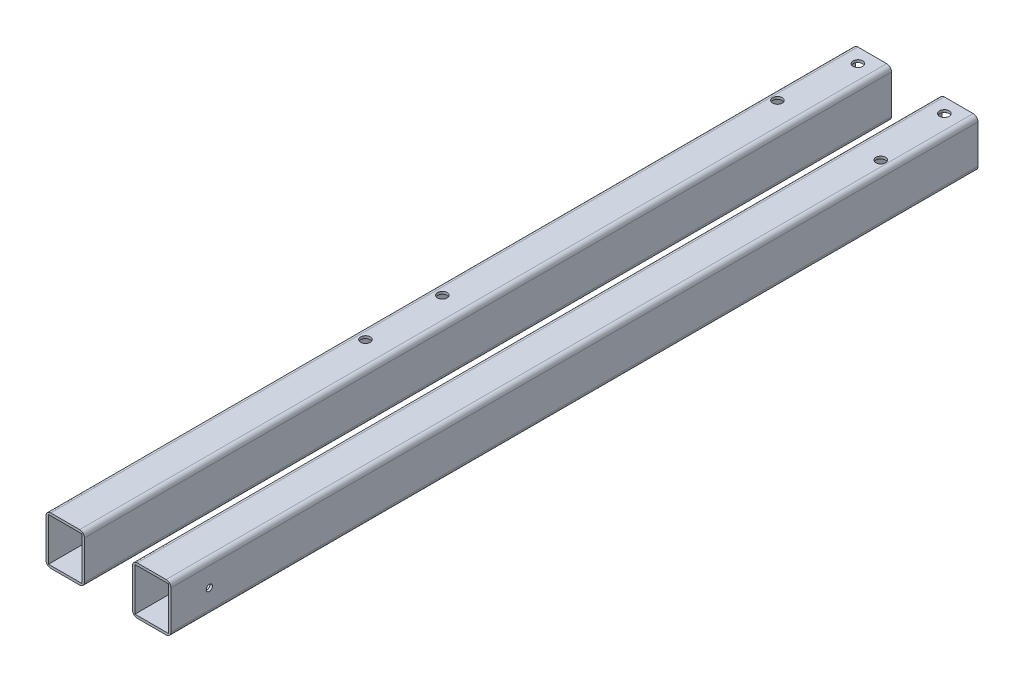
from build123d import *

# Parameters (mm, degrees)
SKETCH1_W             = 25.4
SKETCH1_H             = 31.75
SKETCH1_W_2           = 22.098
SKETCH1_H_2           = 28.448
EXTRUDE_THIN1_DEPTH   = 533.4
EXTRUDE_THIN1_2_DEPTH = 533.4
FILLET1_R             = 3.175
FILLET2_R             = 3.175
CUT_EXTRUDE2_START    = 25.4
SKETCH3_R             = 2.0574
CUT_EXTRUDE2_DEPTH    = 25.4
SKETCH4_R             = 3.175
CUT_EXTRUDE3_DEPTH    = 25.4
SKETCH6_R             = 3.175
CUT_EXTRUDE4_DEPTH    = 25.4


with BuildPart() as part:
    # Sketch1 → Extrude-Thin1 (new body)
    with BuildSketch(Plane.XY):
        with Locations((-28.575, 0)):
            Rectangle(SKETCH1_W, SKETCH1_H)
        with Locations((-28.575, 0)):
            Rectangle(SKETCH1_W_2, SKETCH1_H_2, mode=Mode.SUBTRACT)
    extrude(amount=EXTRUDE_THIN1_DEPTH)

    # Fillet2
    fillet2_edges = [part.edges().sort_by_distance(p)[0] for p in [
        (-15.875, -15.875, 266.7),
        (-41.275, -15.875, 266.7),
        (-41.275, 15.875, 266.7),
        (-15.875, 15.875, 266.7),
    ]]
    fillet(fillet2_edges, radius=FILLET2_R)


with BuildPart() as body_2:
    # Sketch1 → Extrude-Thin1 2 (new body)
    with BuildSketch(Plane.XY):
        with Locations((28.575, 0)):
            Rectangle(SKETCH1_W, SKETCH1_H)
        with Locations((28.575, 0)):
            Rectangle(SKETCH1_W_2, SKETCH1_H_2, mode=Mode.SUBTRACT)
    extrude(amount=EXTRUDE_THIN1_2_DEPTH)

    # Fillet1
    fillet1_edges = [body_2.edges().sort_by_distance(p)[0] for p in [
        (41.275, -15.875, 266.7),
        (15.875, -15.875, 266.7),
        (15.875, 15.875, 266.7),
        (41.275, 15.875, 266.7),
    ]]
    fillet(fillet1_edges, radius=FILLET1_R)

    # Sketch3 → Cut-Extrude2 (cut)
    with BuildSketch(Plane(origin=(0, 0, 0), x_dir=(0, 0, -1), z_dir=(1, 0, 0)).offset(CUT_EXTRUDE2_START)):
        with Locations(Location((-508, 0, 0), (0, 0, 270))):
            Circle(SKETCH3_R)
    extrude(amount=CUT_EXTRUDE2_DEPTH, mode=Mode.SUBTRACT)


with BuildPart() as cut_extrude3_tool:
    # Sketch4 → Cut-Extrude3 (new, symmetric)
    with BuildSketch(Plane(origin=(0, 0, 0), x_dir=(1, 0, 0), z_dir=(0, 1, 0))):
        with Locations(Location((28.575, -9.525, 0), (0, 0, 180))):
            Circle(SKETCH4_R)
        with Locations(Location((34.1376, -57.15, 0), (0, 0, 180))):
            Circle(SKETCH4_R)
        with Locations(Location((-28.575, -9.525, 0), (0, 0, 180))):
            Circle(SKETCH4_R)
        with Locations(Location((-34.1376, -57.15, 0), (0, 0, 180))):
            Circle(SKETCH4_R)
    extrude(amount=CUT_EXTRUDE3_DEPTH, both=True)


with BuildPart() as part_1:
    add(part.part)

    # Cut-Extrude3: cut by cut_extrude3_tool
    add(cut_extrude3_tool.part, mode=Mode.SUBTRACT)

    # Sketch6 → Cut-Extrude4 (cut, symmetric)
    with BuildSketch(Plane(origin=(0, 0, 0), x_dir=(1, 0, 0), z_dir=(0, 1, 0))):
        with Locations(Location((-33.3248, -330.2, 0), (0, 0, 180))):
            Circle(SKETCH6_R)
        with Locations(Location((-33.3248, -279.4, 0), (0, 0, 180))):
            Circle(SKETCH6_R)
    extrude(amount=CUT_EXTRUDE4_DEPTH, both=True, mode=Mode.SUBTRACT)


with BuildPart() as body_2_1:
    add(body_2.part)

    # Cut-Extrude3: cut by cut_extrude3_tool
    add(cut_extrude3_tool.part, mode=Mode.SUBTRACT)


solid = Compound([part_1.part, body_2_1.part])
